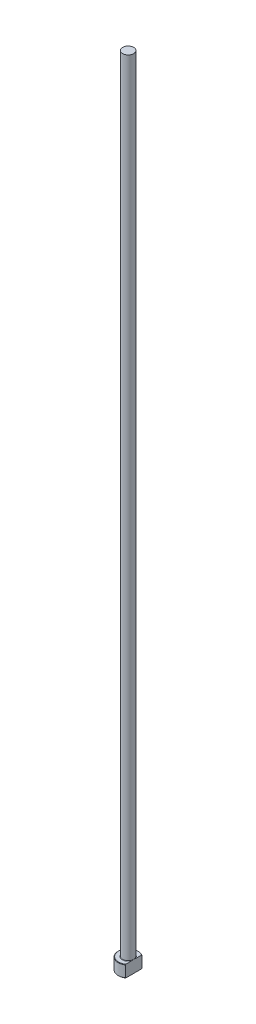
from build123d import *
from build123d.topology import SkipClean

# Parameters (mm, degrees)
CHAMFER1_SIZE    = 0.2
FILLET1_R        = 0.2
KEYED_HEAD_DEPTH = 401.062495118


with BuildPart() as part:
    # Sketch1 → Revolve1 (revolve)
    with BuildSketch(Plane.XY, mode=Mode.PRIVATE) as revolve1_sk:
        Polygon((0, 0), (-5, 0), (-5, 6), (-2.75, 6), (-2.75, 400), (0, 400), align=None)
    revolve(revolve1_sk.sketch.rotate(Axis((0, 259.958771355, 0), (0, -1, 0)), 270), axis=Axis((0, 259.958771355, 0), (0, -1, 0)))

    # Chamfer1
    chamfer1_edges = [part.edges().sort_by_distance(p)[0] for p in [
        (0, 6, -5),
        (0, 0, -5),
    ]]
    chamfer(chamfer1_edges, length=CHAMFER1_SIZE)

    # Fillet1
    fillet1_edges = [part.edges().sort_by_distance(p)[0] for p in [
        (0, 6, -2.75),
    ]]
    fillet(fillet1_edges, radius=FILLET1_R)

    # Sketch2 → KEYED HEAD (cut, through all)
    with SkipClean():  # the faces are left unmerged after this step: merging them gives an invalid solid
        with BuildSketch(Plane(origin=(0, 0, 0), x_dir=(1, 0, 0), z_dir=(0, 1, 0))):
            with BuildLine():
                Line((2.75, -4.175823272), (2.75, 4.175823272))
                ThreePointArc((2.75, 4.175823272), (5, 0), (2.75, -4.175823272))
            make_face()
        extrude(amount=KEYED_HEAD_DEPTH, mode=Mode.SUBTRACT)


solid = part.part
